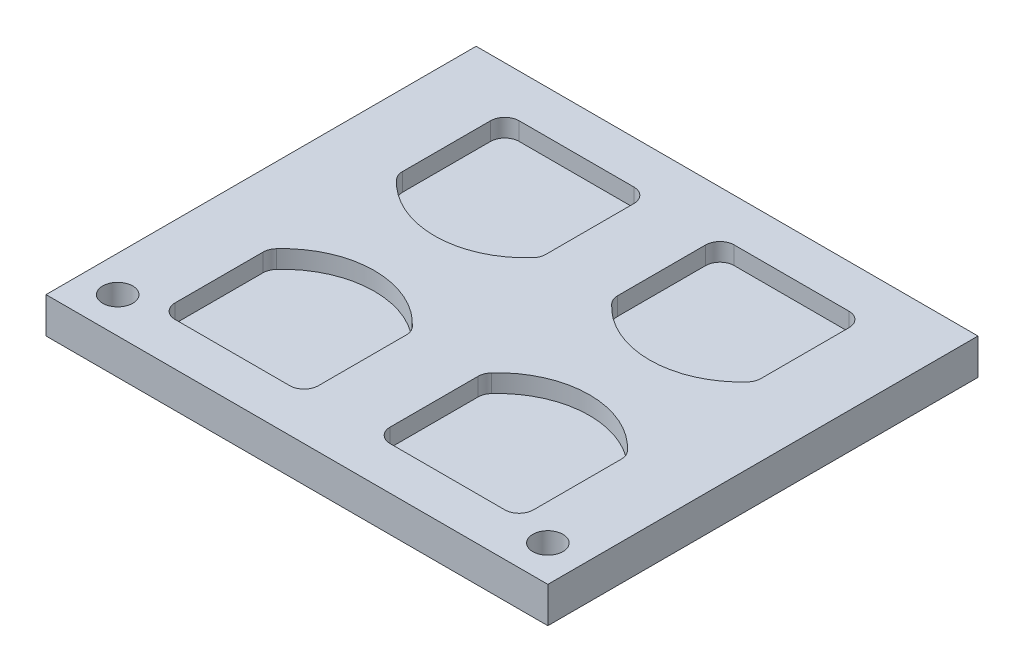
ISO-10303-21;
HEADER;
FILE_DESCRIPTION(('STEP AP214'),'2;1');
FILE_NAME('part.step','',(''),(''),'','','');
FILE_SCHEMA(('AUTOMOTIVE_DESIGN { 1 0 10303 214 1 1 1 1 }'));
ENDSEC;
DATA;
#1=APPLICATION_CONTEXT('core data for automotive mechanical design processes');
#2=APPLICATION_PROTOCOL_DEFINITION('international standard','automotive_design',2000,#1);
#3=PRODUCT_CONTEXT('',#1,'mechanical');
#4=PRODUCT('Part','Part','',(#3));
#5=PRODUCT_RELATED_PRODUCT_CATEGORY('part','',(#4));
#6=PRODUCT_DEFINITION_FORMATION('','',#4);
#7=PRODUCT_DEFINITION_CONTEXT('part definition',#1,'design');
#8=PRODUCT_DEFINITION('design','',#6,#7);
#9=PRODUCT_DEFINITION_SHAPE('','',#8);
#10=(LENGTH_UNIT() NAMED_UNIT(*) SI_UNIT(.MILLI.,.METRE.));
#11=(NAMED_UNIT(*) PLANE_ANGLE_UNIT() SI_UNIT($,.RADIAN.));
#12=(NAMED_UNIT(*) SI_UNIT($,.STERADIAN.) SOLID_ANGLE_UNIT());
#13=UNCERTAINTY_MEASURE_WITH_UNIT(LENGTH_MEASURE(1.E-05),#10,'distance_accuracy_value','');
#14=(GEOMETRIC_REPRESENTATION_CONTEXT(3) GLOBAL_UNCERTAINTY_ASSIGNED_CONTEXT((#13)) GLOBAL_UNIT_ASSIGNED_CONTEXT((#10,
#11,#12)) REPRESENTATION_CONTEXT('',''));
#15=CARTESIAN_POINT('',(0.,0.,0.));
#16=DIRECTION('',(0.,0.,1.));
#17=DIRECTION('',(1.,0.,0.));
#18=AXIS2_PLACEMENT_3D('',#15,#16,#17);
#19=CARTESIAN_POINT('',(0.,0.,0.));
#20=DIRECTION('',(0.,-1.,0.));
#21=DIRECTION('',(0.,0.,-1.));
#22=AXIS2_PLACEMENT_3D('',#19,#20,#21);
#23=PLANE('',#22);
#24=DIRECTION('',(0.,0.,-1.));
#25=VECTOR('',#24,1.);
#26=CARTESIAN_POINT('',(175.,0.,150.));
#27=LINE('',#26,#25);
#28=CARTESIAN_POINT('',(175.,0.,150.));
#29=VERTEX_POINT('',#28);
#30=CARTESIAN_POINT('',(175.,0.,-150.));
#31=VERTEX_POINT('',#30);
#32=EDGE_CURVE('E299',#29,#31,#27,.T.);
#33=ORIENTED_EDGE('',*,*,#32,.F.);
#34=DIRECTION('',(1.,0.,0.));
#35=VECTOR('',#34,1.);
#36=CARTESIAN_POINT('',(-175.,0.,150.));
#37=LINE('',#36,#35);
#38=CARTESIAN_POINT('',(-175.,0.,150.));
#39=VERTEX_POINT('',#38);
#40=EDGE_CURVE('E295',#39,#29,#37,.T.);
#41=ORIENTED_EDGE('',*,*,#40,.F.);
#42=DIRECTION('',(0.,0.,1.));
#43=VECTOR('',#42,1.);
#44=CARTESIAN_POINT('',(-175.,0.,150.));
#45=LINE('',#44,#43);
#46=CARTESIAN_POINT('',(-175.,0.,-150.));
#47=VERTEX_POINT('',#46);
#48=EDGE_CURVE('E369',#47,#39,#45,.T.);
#49=ORIENTED_EDGE('',*,*,#48,.F.);
#50=DIRECTION('',(-1.,0.,0.));
#51=VECTOR('',#50,1.);
#52=CARTESIAN_POINT('',(-175.,0.,-150.));
#53=LINE('',#52,#51);
#54=EDGE_CURVE('E366',#31,#47,#53,.T.);
#55=ORIENTED_EDGE('',*,*,#54,.F.);
#56=EDGE_LOOP('',(#33,#41,#49,#55));
#57=FACE_BOUND('',#56,.T.);
#58=CARTESIAN_POINT('',(150.,0.,125.));
#59=DIRECTION('',(0.,1.,0.));
#60=DIRECTION('',(0.,0.,1.));
#61=AXIS2_PLACEMENT_3D('',#58,#59,#60);
#62=CIRCLE('',#61,10.5);
#63=CARTESIAN_POINT('',(150.,0.,135.5));
#64=VERTEX_POINT('',#63);
#65=EDGE_CURVE('E391',#64,#64,#62,.T.);
#66=ORIENTED_EDGE('',*,*,#65,.T.);
#67=EDGE_LOOP('',(#66));
#68=FACE_BOUND('',#67,.T.);
#69=CARTESIAN_POINT('',(-150.,0.,125.));
#70=DIRECTION('',(0.,1.,0.));
#71=DIRECTION('',(0.,0.,1.));
#72=AXIS2_PLACEMENT_3D('',#69,#70,#71);
#73=CIRCLE('',#72,10.5);
#74=CARTESIAN_POINT('',(-150.,0.,135.5));
#75=VERTEX_POINT('',#74);
#76=EDGE_CURVE('E381',#75,#75,#73,.T.);
#77=ORIENTED_EDGE('',*,*,#76,.T.);
#78=EDGE_LOOP('',(#77));
#79=FACE_BOUND('',#78,.T.);
#80=ADVANCED_FACE('F43',(#57,#68,#79),#23,.T.);
#81=CARTESIAN_POINT('',(175.,25.,150.));
#82=DIRECTION('',(-1.,0.,0.));
#83=DIRECTION('',(0.,0.,1.));
#84=AXIS2_PLACEMENT_3D('',#81,#82,#83);
#85=PLANE('',#84);
#86=ORIENTED_EDGE('',*,*,#32,.T.);
#87=DIRECTION('',(0.,-1.,0.));
#88=VECTOR('',#87,1.);
#89=CARTESIAN_POINT('',(175.,25.,-150.));
#90=LINE('',#89,#88);
#91=CARTESIAN_POINT('',(175.,25.,-150.));
#92=VERTEX_POINT('',#91);
#93=EDGE_CURVE('E279',#92,#31,#90,.T.);
#94=ORIENTED_EDGE('',*,*,#93,.F.);
#95=DIRECTION('',(0.,0.,-1.));
#96=VECTOR('',#95,1.);
#97=CARTESIAN_POINT('',(175.,25.,150.));
#98=LINE('',#97,#96);
#99=CARTESIAN_POINT('',(175.,25.,150.));
#100=VERTEX_POINT('',#99);
#101=EDGE_CURVE('E286',#100,#92,#98,.T.);
#102=ORIENTED_EDGE('',*,*,#101,.F.);
#103=DIRECTION('',(0.,-1.,0.));
#104=VECTOR('',#103,1.);
#105=CARTESIAN_POINT('',(175.,25.,150.));
#106=LINE('',#105,#104);
#107=EDGE_CURVE('E363',#100,#29,#106,.T.);
#108=ORIENTED_EDGE('',*,*,#107,.T.);
#109=EDGE_LOOP('',(#86,#94,#102,#108));
#110=FACE_BOUND('',#109,.T.);
#111=ADVANCED_FACE('F297',(#110),#85,.F.);
#112=CARTESIAN_POINT('',(-175.,25.,-150.));
#113=DIRECTION('',(0.,0.,1.));
#114=DIRECTION('',(1.,0.,0.));
#115=AXIS2_PLACEMENT_3D('',#112,#113,#114);
#116=PLANE('',#115);
#117=ORIENTED_EDGE('',*,*,#54,.T.);
#118=DIRECTION('',(0.,-1.,0.));
#119=VECTOR('',#118,1.);
#120=CARTESIAN_POINT('',(-175.,25.,-150.));
#121=LINE('',#120,#119);
#122=CARTESIAN_POINT('',(-175.,25.,-150.));
#123=VERTEX_POINT('',#122);
#124=EDGE_CURVE('E282',#123,#47,#121,.T.);
#125=ORIENTED_EDGE('',*,*,#124,.F.);
#126=DIRECTION('',(-1.,0.,0.));
#127=VECTOR('',#126,1.);
#128=CARTESIAN_POINT('',(-175.,25.,-150.));
#129=LINE('',#128,#127);
#130=EDGE_CURVE('E275',#92,#123,#129,.T.);
#131=ORIENTED_EDGE('',*,*,#130,.F.);
#132=ORIENTED_EDGE('',*,*,#93,.T.);
#133=EDGE_LOOP('',(#117,#125,#131,#132));
#134=FACE_BOUND('',#133,.T.);
#135=ADVANCED_FACE('F277',(#134),#116,.F.);
#136=CARTESIAN_POINT('',(-175.,25.,150.));
#137=DIRECTION('',(1.,0.,0.));
#138=DIRECTION('',(0.,0.,-1.));
#139=AXIS2_PLACEMENT_3D('',#136,#137,#138);
#140=PLANE('',#139);
#141=ORIENTED_EDGE('',*,*,#48,.T.);
#142=DIRECTION('',(0.,-1.,0.));
#143=VECTOR('',#142,1.);
#144=CARTESIAN_POINT('',(-175.,25.,150.));
#145=LINE('',#144,#143);
#146=CARTESIAN_POINT('',(-175.,25.,150.));
#147=VERTEX_POINT('',#146);
#148=EDGE_CURVE('E304',#147,#39,#145,.T.);
#149=ORIENTED_EDGE('',*,*,#148,.F.);
#150=DIRECTION('',(0.,0.,1.));
#151=VECTOR('',#150,1.);
#152=CARTESIAN_POINT('',(-175.,25.,150.));
#153=LINE('',#152,#151);
#154=EDGE_CURVE('E285',#123,#147,#153,.T.);
#155=ORIENTED_EDGE('',*,*,#154,.F.);
#156=ORIENTED_EDGE('',*,*,#124,.T.);
#157=EDGE_LOOP('',(#141,#149,#155,#156));
#158=FACE_BOUND('',#157,.T.);
#159=ADVANCED_FACE('F712',(#158),#140,.F.);
#160=CARTESIAN_POINT('',(-175.,25.,150.));
#161=DIRECTION('',(0.,0.,-1.));
#162=DIRECTION('',(-1.,0.,0.));
#163=AXIS2_PLACEMENT_3D('',#160,#161,#162);
#164=PLANE('',#163);
#165=ORIENTED_EDGE('',*,*,#40,.T.);
#166=ORIENTED_EDGE('',*,*,#107,.F.);
#167=DIRECTION('',(1.,0.,0.));
#168=VECTOR('',#167,1.);
#169=CARTESIAN_POINT('',(-175.,25.,150.));
#170=LINE('',#169,#168);
#171=EDGE_CURVE('E291',#147,#100,#170,.T.);
#172=ORIENTED_EDGE('',*,*,#171,.F.);
#173=ORIENTED_EDGE('',*,*,#148,.T.);
#174=EDGE_LOOP('',(#165,#166,#172,#173));
#175=FACE_BOUND('',#174,.T.);
#176=ADVANCED_FACE('F709',(#175),#164,.F.);
#177=CARTESIAN_POINT('',(0.,25.,0.));
#178=DIRECTION('',(0.,-1.,0.));
#179=DIRECTION('',(0.,0.,-1.));
#180=AXIS2_PLACEMENT_3D('',#177,#178,#179);
#181=PLANE('',#180);
#182=CARTESIAN_POINT('',(-150.,25.,125.));
#183=DIRECTION('',(0.,1.,0.));
#184=DIRECTION('',(0.,0.,1.));
#185=AXIS2_PLACEMENT_3D('',#182,#183,#184);
#186=CIRCLE('',#185,10.5);
#187=CARTESIAN_POINT('',(-150.,25.,135.5));
#188=VERTEX_POINT('',#187);
#189=EDGE_CURVE('E386',#188,#188,#186,.T.);
#190=ORIENTED_EDGE('',*,*,#189,.F.);
#191=EDGE_LOOP('',(#190));
#192=FACE_BOUND('',#191,.T.);
#193=CARTESIAN_POINT('',(150.,25.,125.));
#194=DIRECTION('',(0.,1.,0.));
#195=DIRECTION('',(0.,0.,1.));
#196=AXIS2_PLACEMENT_3D('',#193,#194,#195);
#197=CIRCLE('',#196,10.5);
#198=CARTESIAN_POINT('',(150.,25.,135.5));
#199=VERTEX_POINT('',#198);
#200=EDGE_CURVE('E385',#199,#199,#197,.T.);
#201=ORIENTED_EDGE('',*,*,#200,.F.);
#202=EDGE_LOOP('',(#201));
#203=FACE_BOUND('',#202,.T.);
#204=DIRECTION('',(0.,0.,-1.));
#205=VECTOR('',#204,1.);
#206=CARTESIAN_POINT('',(-25.,25.,-120.));
#207=LINE('',#206,#205);
#208=CARTESIAN_POINT('',(-25.,25.,-48.6767959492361));
#209=VERTEX_POINT('',#208);
#210=CARTESIAN_POINT('',(-25.,25.,-110.));
#211=VERTEX_POINT('',#210);
#212=EDGE_CURVE('E495',#209,#211,#207,.T.);
#213=ORIENTED_EDGE('',*,*,#212,.F.);
#214=CARTESIAN_POINT('',(-35.,25.,-48.6767959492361));
#215=DIRECTION('',(0.,-1.,0.));
#216=DIRECTION('',(0.,0.,-1.));
#217=AXIS2_PLACEMENT_3D('',#214,#215,#216);
#218=CIRCLE('',#217,10.);
#219=CARTESIAN_POINT('',(-27.5968757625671,25.,-41.9541661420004));
#220=VERTEX_POINT('',#219);
#221=EDGE_CURVE('E491',#209,#220,#218,.T.);
#222=ORIENTED_EDGE('',*,*,#221,.T.);
#223=CARTESIAN_POINT('',(-75.,25.,-85.));
#224=DIRECTION('',(0.,1.,0.));
#225=DIRECTION('',(0.,0.,-1.));
#226=AXIS2_PLACEMENT_3D('',#223,#224,#225);
#227=CIRCLE('',#226,64.0312423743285);
#228=CARTESIAN_POINT('',(-122.403124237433,25.,-41.9541661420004));
#229=VERTEX_POINT('',#228);
#230=EDGE_CURVE('E502',#229,#220,#227,.T.);
#231=ORIENTED_EDGE('',*,*,#230,.F.);
#232=CARTESIAN_POINT('',(-115.,25.,-48.6767959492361));
#233=DIRECTION('',(0.,-1.,0.));
#234=DIRECTION('',(0.,0.,-1.));
#235=AXIS2_PLACEMENT_3D('',#232,#233,#234);
#236=CIRCLE('',#235,10.);
#237=CARTESIAN_POINT('',(-125.,25.,-48.6767959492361));
#238=VERTEX_POINT('',#237);
#239=EDGE_CURVE('E489',#229,#238,#236,.T.);
#240=ORIENTED_EDGE('',*,*,#239,.T.);
#241=DIRECTION('',(0.,0.,1.));
#242=VECTOR('',#241,1.);
#243=CARTESIAN_POINT('',(-125.,25.,-120.));
#244=LINE('',#243,#242);
#245=CARTESIAN_POINT('',(-125.,25.,-110.));
#246=VERTEX_POINT('',#245);
#247=EDGE_CURVE('E407',#246,#238,#244,.T.);
#248=ORIENTED_EDGE('',*,*,#247,.F.);
#249=CARTESIAN_POINT('',(-115.,25.,-110.));
#250=DIRECTION('',(0.,-1.,0.));
#251=DIRECTION('',(0.,0.,-1.));
#252=AXIS2_PLACEMENT_3D('',#249,#250,#251);
#253=CIRCLE('',#252,10.);
#254=CARTESIAN_POINT('',(-115.,25.,-120.));
#255=VERTEX_POINT('',#254);
#256=EDGE_CURVE('E12',#246,#255,#253,.T.);
#257=ORIENTED_EDGE('',*,*,#256,.T.);
#258=DIRECTION('',(-1.,0.,0.));
#259=VECTOR('',#258,1.);
#260=CARTESIAN_POINT('',(-125.,25.,-120.));
#261=LINE('',#260,#259);
#262=CARTESIAN_POINT('',(-35.,25.,-120.));
#263=VERTEX_POINT('',#262);
#264=EDGE_CURVE('E496',#263,#255,#261,.T.);
#265=ORIENTED_EDGE('',*,*,#264,.F.);
#266=CARTESIAN_POINT('',(-35.,25.,-110.));
#267=DIRECTION('',(0.,-1.,0.));
#268=DIRECTION('',(0.,0.,-1.));
#269=AXIS2_PLACEMENT_3D('',#266,#267,#268);
#270=CIRCLE('',#269,10.);
#271=EDGE_CURVE('E51',#263,#211,#270,.T.);
#272=ORIENTED_EDGE('',*,*,#271,.T.);
#273=EDGE_LOOP('',(#213,#222,#231,#240,#248,#257,#265,#272));
#274=FACE_BOUND('',#273,.T.);
#275=DIRECTION('',(0.,0.,-1.));
#276=VECTOR('',#275,1.);
#277=CARTESIAN_POINT('',(125.,25.,-120.));
#278=LINE('',#277,#276);
#279=CARTESIAN_POINT('',(125.,25.,-48.6767959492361));
#280=VERTEX_POINT('',#279);
#281=CARTESIAN_POINT('',(125.,25.,-110.));
#282=VERTEX_POINT('',#281);
#283=EDGE_CURVE('E541',#280,#282,#278,.T.);
#284=ORIENTED_EDGE('',*,*,#283,.F.);
#285=CARTESIAN_POINT('',(115.,25.,-48.6767959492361));
#286=DIRECTION('',(0.,-1.,0.));
#287=DIRECTION('',(0.,0.,-1.));
#288=AXIS2_PLACEMENT_3D('',#285,#286,#287);
#289=CIRCLE('',#288,10.);
#290=CARTESIAN_POINT('',(122.403124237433,25.,-41.9541661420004));
#291=VERTEX_POINT('',#290);
#292=EDGE_CURVE('E471',#280,#291,#289,.T.);
#293=ORIENTED_EDGE('',*,*,#292,.T.);
#294=CARTESIAN_POINT('',(75.,25.,-85.));
#295=DIRECTION('',(0.,1.,0.));
#296=DIRECTION('',(0.,0.,1.));
#297=AXIS2_PLACEMENT_3D('',#294,#295,#296);
#298=CIRCLE('',#297,64.0312423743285);
#299=CARTESIAN_POINT('',(27.5968757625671,25.,-41.9541661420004));
#300=VERTEX_POINT('',#299);
#301=EDGE_CURVE('E518',#300,#291,#298,.T.);
#302=ORIENTED_EDGE('',*,*,#301,.F.);
#303=CARTESIAN_POINT('',(35.,25.,-48.6767959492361));
#304=DIRECTION('',(0.,-1.,0.));
#305=DIRECTION('',(0.,0.,-1.));
#306=AXIS2_PLACEMENT_3D('',#303,#304,#305);
#307=CIRCLE('',#306,10.);
#308=CARTESIAN_POINT('',(25.,25.,-48.6767959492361));
#309=VERTEX_POINT('',#308);
#310=EDGE_CURVE('E465',#300,#309,#307,.T.);
#311=ORIENTED_EDGE('',*,*,#310,.T.);
#312=DIRECTION('',(0.,0.,1.));
#313=VECTOR('',#312,1.);
#314=CARTESIAN_POINT('',(25.,25.,-120.));
#315=LINE('',#314,#313);
#316=CARTESIAN_POINT('',(25.,25.,-110.));
#317=VERTEX_POINT('',#316);
#318=EDGE_CURVE('E535',#317,#309,#315,.T.);
#319=ORIENTED_EDGE('',*,*,#318,.F.);
#320=CARTESIAN_POINT('',(35.,25.,-110.));
#321=DIRECTION('',(0.,-1.,0.));
#322=DIRECTION('',(0.,0.,-1.));
#323=AXIS2_PLACEMENT_3D('',#320,#321,#322);
#324=CIRCLE('',#323,10.);
#325=CARTESIAN_POINT('',(35.,25.,-120.));
#326=VERTEX_POINT('',#325);
#327=EDGE_CURVE('E467',#317,#326,#324,.T.);
#328=ORIENTED_EDGE('',*,*,#327,.T.);
#329=DIRECTION('',(-1.,0.,0.));
#330=VECTOR('',#329,1.);
#331=CARTESIAN_POINT('',(125.,25.,-120.));
#332=LINE('',#331,#330);
#333=CARTESIAN_POINT('',(115.,25.,-120.));
#334=VERTEX_POINT('',#333);
#335=EDGE_CURVE('E538',#334,#326,#332,.T.);
#336=ORIENTED_EDGE('',*,*,#335,.F.);
#337=CARTESIAN_POINT('',(115.,25.,-110.));
#338=DIRECTION('',(0.,-1.,0.));
#339=DIRECTION('',(0.,0.,-1.));
#340=AXIS2_PLACEMENT_3D('',#337,#338,#339);
#341=CIRCLE('',#340,10.);
#342=EDGE_CURVE('E469',#334,#282,#341,.T.);
#343=ORIENTED_EDGE('',*,*,#342,.T.);
#344=EDGE_LOOP('',(#284,#293,#302,#311,#319,#328,#336,#343));
#345=FACE_BOUND('',#344,.T.);
#346=DIRECTION('',(0.,0.,1.));
#347=VECTOR('',#346,1.);
#348=CARTESIAN_POINT('',(25.,25.,120.));
#349=LINE('',#348,#347);
#350=CARTESIAN_POINT('',(25.,25.,48.6767959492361));
#351=VERTEX_POINT('',#350);
#352=CARTESIAN_POINT('',(25.,25.,110.));
#353=VERTEX_POINT('',#352);
#354=EDGE_CURVE('E1142',#351,#353,#349,.T.);
#355=ORIENTED_EDGE('',*,*,#354,.F.);
#356=CARTESIAN_POINT('',(35.,25.,48.6767959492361));
#357=DIRECTION('',(0.,-1.,0.));
#358=DIRECTION('',(0.,0.,-1.));
#359=AXIS2_PLACEMENT_3D('',#356,#357,#358);
#360=CIRCLE('',#359,10.);
#361=CARTESIAN_POINT('',(27.5968757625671,25.,41.9541661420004));
#362=VERTEX_POINT('',#361);
#363=EDGE_CURVE('E479',#351,#362,#360,.T.);
#364=ORIENTED_EDGE('',*,*,#363,.T.);
#365=CARTESIAN_POINT('',(75.,25.,85.));
#366=DIRECTION('',(0.,1.,0.));
#367=DIRECTION('',(0.,0.,-1.));
#368=AXIS2_PLACEMENT_3D('',#365,#366,#367);
#369=CIRCLE('',#368,64.0312423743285);
#370=CARTESIAN_POINT('',(122.403124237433,25.,41.9541661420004));
#371=VERTEX_POINT('',#370);
#372=EDGE_CURVE('E632',#371,#362,#369,.T.);
#373=ORIENTED_EDGE('',*,*,#372,.F.);
#374=CARTESIAN_POINT('',(115.,25.,48.6767959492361));
#375=DIRECTION('',(0.,-1.,0.));
#376=DIRECTION('',(0.,0.,-1.));
#377=AXIS2_PLACEMENT_3D('',#374,#375,#376);
#378=CIRCLE('',#377,10.);
#379=CARTESIAN_POINT('',(125.,25.,48.6767959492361));
#380=VERTEX_POINT('',#379);
#381=EDGE_CURVE('E477',#371,#380,#378,.T.);
#382=ORIENTED_EDGE('',*,*,#381,.T.);
#383=DIRECTION('',(0.,0.,-1.));
#384=VECTOR('',#383,1.);
#385=CARTESIAN_POINT('',(125.,25.,120.));
#386=LINE('',#385,#384);
#387=CARTESIAN_POINT('',(125.,25.,110.));
#388=VERTEX_POINT('',#387);
#389=EDGE_CURVE('E1146',#388,#380,#386,.T.);
#390=ORIENTED_EDGE('',*,*,#389,.F.);
#391=CARTESIAN_POINT('',(115.,25.,110.));
#392=DIRECTION('',(0.,-1.,0.));
#393=DIRECTION('',(0.,0.,-1.));
#394=AXIS2_PLACEMENT_3D('',#391,#392,#393);
#395=CIRCLE('',#394,10.);
#396=CARTESIAN_POINT('',(115.,25.,120.));
#397=VERTEX_POINT('',#396);
#398=EDGE_CURVE('E475',#388,#397,#395,.T.);
#399=ORIENTED_EDGE('',*,*,#398,.T.);
#400=DIRECTION('',(1.,0.,0.));
#401=VECTOR('',#400,1.);
#402=CARTESIAN_POINT('',(125.,25.,120.));
#403=LINE('',#402,#401);
#404=CARTESIAN_POINT('',(35.,25.,120.));
#405=VERTEX_POINT('',#404);
#406=EDGE_CURVE('E1143',#405,#397,#403,.T.);
#407=ORIENTED_EDGE('',*,*,#406,.F.);
#408=CARTESIAN_POINT('',(35.,25.,110.));
#409=DIRECTION('',(0.,-1.,0.));
#410=DIRECTION('',(0.,0.,-1.));
#411=AXIS2_PLACEMENT_3D('',#408,#409,#410);
#412=CIRCLE('',#411,10.);
#413=EDGE_CURVE('E473',#405,#353,#412,.T.);
#414=ORIENTED_EDGE('',*,*,#413,.T.);
#415=EDGE_LOOP('',(#355,#364,#373,#382,#390,#399,#407,#414));
#416=FACE_BOUND('',#415,.T.);
#417=DIRECTION('',(1.,0.,0.));
#418=VECTOR('',#417,1.);
#419=CARTESIAN_POINT('',(-125.,25.,120.));
#420=LINE('',#419,#418);
#421=CARTESIAN_POINT('',(-115.,25.,120.));
#422=VERTEX_POINT('',#421);
#423=CARTESIAN_POINT('',(-35.,25.,120.));
#424=VERTEX_POINT('',#423);
#425=EDGE_CURVE('E644',#422,#424,#420,.T.);
#426=ORIENTED_EDGE('',*,*,#425,.F.);
#427=CARTESIAN_POINT('',(-115.,25.,110.));
#428=DIRECTION('',(0.,-1.,0.));
#429=DIRECTION('',(0.,0.,-1.));
#430=AXIS2_PLACEMENT_3D('',#427,#428,#429);
#431=CIRCLE('',#430,10.);
#432=CARTESIAN_POINT('',(-125.,25.,110.));
#433=VERTEX_POINT('',#432);
#434=EDGE_CURVE('E481',#422,#433,#431,.T.);
#435=ORIENTED_EDGE('',*,*,#434,.T.);
#436=DIRECTION('',(0.,0.,1.));
#437=VECTOR('',#436,1.);
#438=CARTESIAN_POINT('',(-125.,25.,120.));
#439=LINE('',#438,#437);
#440=CARTESIAN_POINT('',(-125.,25.,48.6767959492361));
#441=VERTEX_POINT('',#440);
#442=EDGE_CURVE('E631',#441,#433,#439,.T.);
#443=ORIENTED_EDGE('',*,*,#442,.F.);
#444=CARTESIAN_POINT('',(-115.,25.,48.6767959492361));
#445=DIRECTION('',(0.,-1.,0.));
#446=DIRECTION('',(0.,0.,-1.));
#447=AXIS2_PLACEMENT_3D('',#444,#445,#446);
#448=CIRCLE('',#447,10.);
#449=CARTESIAN_POINT('',(-122.403124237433,25.,41.9541661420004));
#450=VERTEX_POINT('',#449);
#451=EDGE_CURVE('E487',#441,#450,#448,.T.);
#452=ORIENTED_EDGE('',*,*,#451,.T.);
#453=CARTESIAN_POINT('',(-75.,25.,85.));
#454=DIRECTION('',(0.,1.,0.));
#455=DIRECTION('',(0.,0.,1.));
#456=AXIS2_PLACEMENT_3D('',#453,#454,#455);
#457=CIRCLE('',#456,64.0312423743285);
#458=CARTESIAN_POINT('',(-27.5968757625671,25.,41.9541661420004));
#459=VERTEX_POINT('',#458);
#460=EDGE_CURVE('E406',#459,#450,#457,.T.);
#461=ORIENTED_EDGE('',*,*,#460,.F.);
#462=CARTESIAN_POINT('',(-35.,25.,48.6767959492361));
#463=DIRECTION('',(0.,-1.,0.));
#464=DIRECTION('',(0.,0.,-1.));
#465=AXIS2_PLACEMENT_3D('',#462,#463,#464);
#466=CIRCLE('',#465,10.);
#467=CARTESIAN_POINT('',(-25.,25.,48.6767959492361));
#468=VERTEX_POINT('',#467);
#469=EDGE_CURVE('E485',#459,#468,#466,.T.);
#470=ORIENTED_EDGE('',*,*,#469,.T.);
#471=DIRECTION('',(0.,0.,-1.));
#472=VECTOR('',#471,1.);
#473=CARTESIAN_POINT('',(-25.,25.,120.));
#474=LINE('',#473,#472);
#475=CARTESIAN_POINT('',(-25.,25.,110.));
#476=VERTEX_POINT('',#475);
#477=EDGE_CURVE('E641',#476,#468,#474,.T.);
#478=ORIENTED_EDGE('',*,*,#477,.F.);
#479=CARTESIAN_POINT('',(-35.,25.,110.));
#480=DIRECTION('',(0.,-1.,0.));
#481=DIRECTION('',(0.,0.,-1.));
#482=AXIS2_PLACEMENT_3D('',#479,#480,#481);
#483=CIRCLE('',#482,10.);
#484=EDGE_CURVE('E483',#476,#424,#483,.T.);
#485=ORIENTED_EDGE('',*,*,#484,.T.);
#486=EDGE_LOOP('',(#426,#435,#443,#452,#461,#470,#478,#485));
#487=FACE_BOUND('',#486,.T.);
#488=ORIENTED_EDGE('',*,*,#101,.T.);
#489=ORIENTED_EDGE('',*,*,#130,.T.);
#490=ORIENTED_EDGE('',*,*,#154,.T.);
#491=ORIENTED_EDGE('',*,*,#171,.T.);
#492=EDGE_LOOP('',(#488,#489,#490,#491));
#493=FACE_BOUND('',#492,.T.);
#494=ADVANCED_FACE('F289',(#192,#203,#274,#345,#416,#487,#493),#181,.F.);
#495=CARTESIAN_POINT('',(-125.,12.5,120.));
#496=DIRECTION('',(-1.,0.,0.));
#497=DIRECTION('',(0.,0.,1.));
#498=AXIS2_PLACEMENT_3D('',#495,#496,#497);
#499=PLANE('',#498);
#500=ORIENTED_EDGE('',*,*,#442,.T.);
#501=DIRECTION('',(0.,1.,0.));
#502=VECTOR('',#501,1.);
#503=CARTESIAN_POINT('',(-125.,12.5,110.));
#504=LINE('',#503,#502);
#505=CARTESIAN_POINT('',(-125.,12.5,110.));
#506=VERTEX_POINT('',#505);
#507=EDGE_CURVE('E608',#433,#506,#504,.F.);
#508=ORIENTED_EDGE('',*,*,#507,.T.);
#509=DIRECTION('',(0.,0.,1.));
#510=VECTOR('',#509,1.);
#511=CARTESIAN_POINT('',(-125.,12.5,120.));
#512=LINE('',#511,#510);
#513=CARTESIAN_POINT('',(-125.,12.5,48.6767959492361));
#514=VERTEX_POINT('',#513);
#515=EDGE_CURVE('E400',#514,#506,#512,.T.);
#516=ORIENTED_EDGE('',*,*,#515,.F.);
#517=DIRECTION('',(0.,-1.,0.));
#518=VECTOR('',#517,1.);
#519=CARTESIAN_POINT('',(-125.,25.,48.6767959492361));
#520=LINE('',#519,#518);
#521=EDGE_CURVE('E605',#514,#441,#520,.F.);
#522=ORIENTED_EDGE('',*,*,#521,.T.);
#523=EDGE_LOOP('',(#500,#508,#516,#522));
#524=FACE_BOUND('',#523,.T.);
#525=ADVANCED_FACE('F677',(#524),#499,.F.);
#526=CARTESIAN_POINT('',(-75.,12.5,85.));
#527=DIRECTION('',(0.,1.,0.));
#528=DIRECTION('',(0.,0.,1.));
#529=AXIS2_PLACEMENT_3D('',#526,#527,#528);
#530=CYLINDRICAL_SURFACE('',#529,64.0312423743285);
#531=CARTESIAN_POINT('',(-75.,12.5,85.));
#532=DIRECTION('',(0.,1.,0.));
#533=DIRECTION('',(0.,0.,1.));
#534=AXIS2_PLACEMENT_3D('',#531,#532,#533);
#535=CIRCLE('',#534,64.0312423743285);
#536=CARTESIAN_POINT('',(-27.5968757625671,12.5,41.9541661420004));
#537=VERTEX_POINT('',#536);
#538=CARTESIAN_POINT('',(-122.403124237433,12.5,41.9541661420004));
#539=VERTEX_POINT('',#538);
#540=EDGE_CURVE('E367',#537,#539,#535,.T.);
#541=ORIENTED_EDGE('',*,*,#540,.F.);
#542=DIRECTION('',(0.,1.,0.));
#543=VECTOR('',#542,1.);
#544=CARTESIAN_POINT('',(-27.5968757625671,12.5,41.9541661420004));
#545=LINE('',#544,#543);
#546=EDGE_CURVE('E435',#537,#459,#545,.T.);
#547=ORIENTED_EDGE('',*,*,#546,.T.);
#548=ORIENTED_EDGE('',*,*,#460,.T.);
#549=DIRECTION('',(0.,1.,0.));
#550=VECTOR('',#549,1.);
#551=CARTESIAN_POINT('',(-122.403124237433,12.5,41.9541661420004));
#552=LINE('',#551,#550);
#553=EDGE_CURVE('E433',#450,#539,#552,.F.);
#554=ORIENTED_EDGE('',*,*,#553,.T.);
#555=EDGE_LOOP('',(#541,#547,#548,#554));
#556=FACE_BOUND('',#555,.T.);
#557=ADVANCED_FACE('F666',(#556),#530,.F.);
#558=CARTESIAN_POINT('',(-25.,12.5,120.));
#559=DIRECTION('',(1.,0.,0.));
#560=DIRECTION('',(0.,0.,-1.));
#561=AXIS2_PLACEMENT_3D('',#558,#559,#560);
#562=PLANE('',#561);
#563=DIRECTION('',(0.,0.,-1.));
#564=VECTOR('',#563,1.);
#565=CARTESIAN_POINT('',(-25.,12.5,120.));
#566=LINE('',#565,#564);
#567=CARTESIAN_POINT('',(-25.,12.5,110.));
#568=VERTEX_POINT('',#567);
#569=CARTESIAN_POINT('',(-25.,12.5,48.6767959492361));
#570=VERTEX_POINT('',#569);
#571=EDGE_CURVE('E412',#568,#570,#566,.T.);
#572=ORIENTED_EDGE('',*,*,#571,.F.);
#573=DIRECTION('',(0.,1.,0.));
#574=VECTOR('',#573,1.);
#575=CARTESIAN_POINT('',(-25.,25.,110.));
#576=LINE('',#575,#574);
#577=EDGE_CURVE('E430',#568,#476,#576,.T.);
#578=ORIENTED_EDGE('',*,*,#577,.T.);
#579=ORIENTED_EDGE('',*,*,#477,.T.);
#580=DIRECTION('',(0.,-1.,0.));
#581=VECTOR('',#580,1.);
#582=CARTESIAN_POINT('',(-25.,12.5,48.6767959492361));
#583=LINE('',#582,#581);
#584=EDGE_CURVE('E428',#468,#570,#583,.T.);
#585=ORIENTED_EDGE('',*,*,#584,.T.);
#586=EDGE_LOOP('',(#572,#578,#579,#585));
#587=FACE_BOUND('',#586,.T.);
#588=ADVANCED_FACE('F689',(#587),#562,.F.);
#589=CARTESIAN_POINT('',(-125.,12.5,120.));
#590=DIRECTION('',(0.,0.,1.));
#591=DIRECTION('',(1.,0.,0.));
#592=AXIS2_PLACEMENT_3D('',#589,#590,#591);
#593=PLANE('',#592);
#594=DIRECTION('',(1.,0.,0.));
#595=VECTOR('',#594,1.);
#596=CARTESIAN_POINT('',(-125.,12.5,120.));
#597=LINE('',#596,#595);
#598=CARTESIAN_POINT('',(-115.,12.5,120.));
#599=VERTEX_POINT('',#598);
#600=CARTESIAN_POINT('',(-35.,12.5,120.));
#601=VERTEX_POINT('',#600);
#602=EDGE_CURVE('E405',#599,#601,#597,.T.);
#603=ORIENTED_EDGE('',*,*,#602,.F.);
#604=DIRECTION('',(0.,1.,0.));
#605=VECTOR('',#604,1.);
#606=CARTESIAN_POINT('',(-115.,25.,120.));
#607=LINE('',#606,#605);
#608=EDGE_CURVE('E602',#599,#422,#607,.T.);
#609=ORIENTED_EDGE('',*,*,#608,.T.);
#610=ORIENTED_EDGE('',*,*,#425,.T.);
#611=DIRECTION('',(0.,1.,0.));
#612=VECTOR('',#611,1.);
#613=CARTESIAN_POINT('',(-35.,12.5,120.));
#614=LINE('',#613,#612);
#615=EDGE_CURVE('E600',#424,#601,#614,.F.);
#616=ORIENTED_EDGE('',*,*,#615,.T.);
#617=EDGE_LOOP('',(#603,#609,#610,#616));
#618=FACE_BOUND('',#617,.T.);
#619=ADVANCED_FACE('F685',(#618),#593,.F.);
#620=CARTESIAN_POINT('',(-75.,12.5,85.));
#621=DIRECTION('',(0.,1.,0.));
#622=DIRECTION('',(0.,0.,1.));
#623=AXIS2_PLACEMENT_3D('',#620,#621,#622);
#624=PLANE('',#623);
#625=ORIENTED_EDGE('',*,*,#515,.T.);
#626=CARTESIAN_POINT('',(-115.,12.5,110.));
#627=DIRECTION('',(0.,1.,0.));
#628=DIRECTION('',(0.,0.,1.));
#629=AXIS2_PLACEMENT_3D('',#626,#627,#628);
#630=CIRCLE('',#629,10.);
#631=EDGE_CURVE('E422',#506,#599,#630,.T.);
#632=ORIENTED_EDGE('',*,*,#631,.T.);
#633=ORIENTED_EDGE('',*,*,#602,.T.);
#634=CARTESIAN_POINT('',(-35.,12.5,110.));
#635=DIRECTION('',(0.,1.,0.));
#636=DIRECTION('',(0.,0.,1.));
#637=AXIS2_PLACEMENT_3D('',#634,#635,#636);
#638=CIRCLE('',#637,10.);
#639=EDGE_CURVE('E419',#601,#568,#638,.T.);
#640=ORIENTED_EDGE('',*,*,#639,.T.);
#641=ORIENTED_EDGE('',*,*,#571,.T.);
#642=CARTESIAN_POINT('',(-35.,12.5,48.6767959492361));
#643=DIRECTION('',(0.,1.,0.));
#644=DIRECTION('',(0.,0.,1.));
#645=AXIS2_PLACEMENT_3D('',#642,#643,#644);
#646=CIRCLE('',#645,10.);
#647=EDGE_CURVE('E423',#570,#537,#646,.T.);
#648=ORIENTED_EDGE('',*,*,#647,.T.);
#649=ORIENTED_EDGE('',*,*,#540,.T.);
#650=CARTESIAN_POINT('',(-115.,12.5,48.6767959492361));
#651=DIRECTION('',(0.,1.,0.));
#652=DIRECTION('',(0.,0.,1.));
#653=AXIS2_PLACEMENT_3D('',#650,#651,#652);
#654=CIRCLE('',#653,10.);
#655=EDGE_CURVE('E609',#539,#514,#654,.T.);
#656=ORIENTED_EDGE('',*,*,#655,.T.);
#657=EDGE_LOOP('',(#625,#632,#633,#640,#641,#648,#649,#656));
#658=FACE_BOUND('',#657,.T.);
#659=ADVANCED_FACE('F656',(#658),#624,.T.);
#660=CARTESIAN_POINT('',(75.,12.5,85.));
#661=DIRECTION('',(0.,1.,0.));
#662=DIRECTION('',(0.,0.,1.));
#663=AXIS2_PLACEMENT_3D('',#660,#661,#662);
#664=CYLINDRICAL_SURFACE('',#663,64.0312423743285);
#665=CARTESIAN_POINT('',(75.,12.5,85.));
#666=DIRECTION('',(0.,1.,0.));
#667=DIRECTION('',(0.,0.,-1.));
#668=AXIS2_PLACEMENT_3D('',#665,#666,#667);
#669=CIRCLE('',#668,64.0312423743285);
#670=CARTESIAN_POINT('',(122.403124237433,12.5,41.9541661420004));
#671=VERTEX_POINT('',#670);
#672=CARTESIAN_POINT('',(27.5968757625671,12.5,41.9541661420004));
#673=VERTEX_POINT('',#672);
#674=EDGE_CURVE('E622',#671,#673,#669,.T.);
#675=ORIENTED_EDGE('',*,*,#674,.F.);
#676=DIRECTION('',(0.,1.,0.));
#677=VECTOR('',#676,1.);
#678=CARTESIAN_POINT('',(122.403124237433,12.5,41.9541661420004));
#679=LINE('',#678,#677);
#680=EDGE_CURVE('E597',#671,#371,#679,.T.);
#681=ORIENTED_EDGE('',*,*,#680,.T.);
#682=ORIENTED_EDGE('',*,*,#372,.T.);
#683=DIRECTION('',(0.,1.,0.));
#684=VECTOR('',#683,1.);
#685=CARTESIAN_POINT('',(27.5968757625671,12.5,41.9541661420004));
#686=LINE('',#685,#684);
#687=EDGE_CURVE('E595',#362,#673,#686,.F.);
#688=ORIENTED_EDGE('',*,*,#687,.T.);
#689=EDGE_LOOP('',(#675,#681,#682,#688));
#690=FACE_BOUND('',#689,.T.);
#691=ADVANCED_FACE('F792',(#690),#664,.F.);
#692=CARTESIAN_POINT('',(125.,12.5,120.));
#693=DIRECTION('',(1.,0.,0.));
#694=DIRECTION('',(0.,0.,-1.));
#695=AXIS2_PLACEMENT_3D('',#692,#693,#694);
#696=PLANE('',#695);
#697=DIRECTION('',(0.,0.,-1.));
#698=VECTOR('',#697,1.);
#699=CARTESIAN_POINT('',(125.,12.5,120.));
#700=LINE('',#699,#698);
#701=CARTESIAN_POINT('',(125.,12.5,110.));
#702=VERTEX_POINT('',#701);
#703=CARTESIAN_POINT('',(125.,12.5,48.6767959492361));
#704=VERTEX_POINT('',#703);
#705=EDGE_CURVE('E627',#702,#704,#700,.T.);
#706=ORIENTED_EDGE('',*,*,#705,.F.);
#707=DIRECTION('',(0.,1.,0.));
#708=VECTOR('',#707,1.);
#709=CARTESIAN_POINT('',(125.,25.,110.));
#710=LINE('',#709,#708);
#711=EDGE_CURVE('E592',#702,#388,#710,.T.);
#712=ORIENTED_EDGE('',*,*,#711,.T.);
#713=ORIENTED_EDGE('',*,*,#389,.T.);
#714=DIRECTION('',(0.,-1.,0.));
#715=VECTOR('',#714,1.);
#716=CARTESIAN_POINT('',(125.,12.5,48.6767959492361));
#717=LINE('',#716,#715);
#718=EDGE_CURVE('E590',#380,#704,#717,.T.);
#719=ORIENTED_EDGE('',*,*,#718,.T.);
#720=EDGE_LOOP('',(#706,#712,#713,#719));
#721=FACE_BOUND('',#720,.T.);
#722=ADVANCED_FACE('F796',(#721),#696,.F.);
#723=CARTESIAN_POINT('',(125.,12.5,120.));
#724=DIRECTION('',(0.,0.,1.));
#725=DIRECTION('',(1.,0.,0.));
#726=AXIS2_PLACEMENT_3D('',#723,#724,#725);
#727=PLANE('',#726);
#728=DIRECTION('',(1.,0.,0.));
#729=VECTOR('',#728,1.);
#730=CARTESIAN_POINT('',(125.,12.5,120.));
#731=LINE('',#730,#729);
#732=CARTESIAN_POINT('',(35.,12.5,120.));
#733=VERTEX_POINT('',#732);
#734=CARTESIAN_POINT('',(115.,12.5,120.));
#735=VERTEX_POINT('',#734);
#736=EDGE_CURVE('E621',#733,#735,#731,.T.);
#737=ORIENTED_EDGE('',*,*,#736,.F.);
#738=DIRECTION('',(0.,1.,0.));
#739=VECTOR('',#738,1.);
#740=CARTESIAN_POINT('',(35.,25.,120.));
#741=LINE('',#740,#739);
#742=EDGE_CURVE('E570',#733,#405,#741,.T.);
#743=ORIENTED_EDGE('',*,*,#742,.T.);
#744=ORIENTED_EDGE('',*,*,#406,.T.);
#745=DIRECTION('',(0.,1.,0.));
#746=VECTOR('',#745,1.);
#747=CARTESIAN_POINT('',(115.,12.5,120.));
#748=LINE('',#747,#746);
#749=EDGE_CURVE('E568',#397,#735,#748,.F.);
#750=ORIENTED_EDGE('',*,*,#749,.T.);
#751=EDGE_LOOP('',(#737,#743,#744,#750));
#752=FACE_BOUND('',#751,.T.);
#753=ADVANCED_FACE('F802',(#752),#727,.F.);
#754=CARTESIAN_POINT('',(25.,12.5,120.));
#755=DIRECTION('',(-1.,0.,0.));
#756=DIRECTION('',(0.,0.,1.));
#757=AXIS2_PLACEMENT_3D('',#754,#755,#756);
#758=PLANE('',#757);
#759=ORIENTED_EDGE('',*,*,#354,.T.);
#760=DIRECTION('',(0.,1.,0.));
#761=VECTOR('',#760,1.);
#762=CARTESIAN_POINT('',(25.,12.5,110.));
#763=LINE('',#762,#761);
#764=CARTESIAN_POINT('',(25.,12.5,110.));
#765=VERTEX_POINT('',#764);
#766=EDGE_CURVE('E580',#353,#765,#763,.F.);
#767=ORIENTED_EDGE('',*,*,#766,.T.);
#768=DIRECTION('',(0.,0.,1.));
#769=VECTOR('',#768,1.);
#770=CARTESIAN_POINT('',(25.,12.5,120.));
#771=LINE('',#770,#769);
#772=CARTESIAN_POINT('',(25.,12.5,48.6767959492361));
#773=VERTEX_POINT('',#772);
#774=EDGE_CURVE('E618',#773,#765,#771,.T.);
#775=ORIENTED_EDGE('',*,*,#774,.F.);
#776=DIRECTION('',(0.,-1.,0.));
#777=VECTOR('',#776,1.);
#778=CARTESIAN_POINT('',(25.,25.,48.6767959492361));
#779=LINE('',#778,#777);
#780=EDGE_CURVE('E577',#773,#351,#779,.F.);
#781=ORIENTED_EDGE('',*,*,#780,.T.);
#782=EDGE_LOOP('',(#759,#767,#775,#781));
#783=FACE_BOUND('',#782,.T.);
#784=ADVANCED_FACE('F807',(#783),#758,.F.);
#785=CARTESIAN_POINT('',(75.,12.5,85.));
#786=DIRECTION('',(0.,-1.,0.));
#787=DIRECTION('',(0.,0.,-1.));
#788=AXIS2_PLACEMENT_3D('',#785,#786,#787);
#789=PLANE('',#788);
#790=ORIENTED_EDGE('',*,*,#774,.T.);
#791=CARTESIAN_POINT('',(35.,12.5,110.));
#792=DIRECTION('',(0.,-1.,0.));
#793=DIRECTION('',(0.,0.,-1.));
#794=AXIS2_PLACEMENT_3D('',#791,#792,#793);
#795=CIRCLE('',#794,10.);
#796=EDGE_CURVE('E588',#765,#733,#795,.F.);
#797=ORIENTED_EDGE('',*,*,#796,.T.);
#798=ORIENTED_EDGE('',*,*,#736,.T.);
#799=CARTESIAN_POINT('',(115.,12.5,110.));
#800=DIRECTION('',(0.,-1.,0.));
#801=DIRECTION('',(0.,0.,-1.));
#802=AXIS2_PLACEMENT_3D('',#799,#800,#801);
#803=CIRCLE('',#802,10.);
#804=EDGE_CURVE('E586',#735,#702,#803,.F.);
#805=ORIENTED_EDGE('',*,*,#804,.T.);
#806=ORIENTED_EDGE('',*,*,#705,.T.);
#807=CARTESIAN_POINT('',(115.,12.5,48.6767959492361));
#808=DIRECTION('',(0.,-1.,0.));
#809=DIRECTION('',(0.,0.,-1.));
#810=AXIS2_PLACEMENT_3D('',#807,#808,#809);
#811=CIRCLE('',#810,10.);
#812=EDGE_CURVE('E584',#704,#671,#811,.F.);
#813=ORIENTED_EDGE('',*,*,#812,.T.);
#814=ORIENTED_EDGE('',*,*,#674,.T.);
#815=CARTESIAN_POINT('',(35.,12.5,48.6767959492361));
#816=DIRECTION('',(0.,-1.,0.));
#817=DIRECTION('',(0.,0.,-1.));
#818=AXIS2_PLACEMENT_3D('',#815,#816,#817);
#819=CIRCLE('',#818,10.);
#820=EDGE_CURVE('E582',#673,#773,#819,.F.);
#821=ORIENTED_EDGE('',*,*,#820,.T.);
#822=EDGE_LOOP('',(#790,#797,#798,#805,#806,#813,#814,#821));
#823=FACE_BOUND('',#822,.T.);
#824=ADVANCED_FACE('F822',(#823),#789,.F.);
#825=CARTESIAN_POINT('',(75.,12.5,-85.));
#826=DIRECTION('',(0.,1.,0.));
#827=DIRECTION('',(0.,0.,1.));
#828=AXIS2_PLACEMENT_3D('',#825,#826,#827);
#829=CYLINDRICAL_SURFACE('',#828,64.0312423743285);
#830=CARTESIAN_POINT('',(75.,12.5,-85.));
#831=DIRECTION('',(0.,1.,0.));
#832=DIRECTION('',(0.,0.,1.));
#833=AXIS2_PLACEMENT_3D('',#830,#831,#832);
#834=CIRCLE('',#833,64.0312423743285);
#835=CARTESIAN_POINT('',(27.5968757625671,12.5,-41.9541661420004));
#836=VERTEX_POINT('',#835);
#837=CARTESIAN_POINT('',(122.403124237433,12.5,-41.9541661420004));
#838=VERTEX_POINT('',#837);
#839=EDGE_CURVE('E334',#836,#838,#834,.T.);
#840=ORIENTED_EDGE('',*,*,#839,.F.);
#841=DIRECTION('',(0.,1.,0.));
#842=VECTOR('',#841,1.);
#843=CARTESIAN_POINT('',(27.5968757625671,12.5,-41.9541661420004));
#844=LINE('',#843,#842);
#845=EDGE_CURVE('E302',#836,#300,#844,.T.);
#846=ORIENTED_EDGE('',*,*,#845,.T.);
#847=ORIENTED_EDGE('',*,*,#301,.T.);
#848=DIRECTION('',(0.,1.,0.));
#849=VECTOR('',#848,1.);
#850=CARTESIAN_POINT('',(122.403124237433,12.5,-41.9541661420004));
#851=LINE('',#850,#849);
#852=EDGE_CURVE('E300',#291,#838,#851,.F.);
#853=ORIENTED_EDGE('',*,*,#852,.T.);
#854=EDGE_LOOP('',(#840,#846,#847,#853));
#855=FACE_BOUND('',#854,.T.);
#856=ADVANCED_FACE('F548',(#855),#829,.F.);
#857=CARTESIAN_POINT('',(25.,12.5,-120.));
#858=DIRECTION('',(-1.,0.,0.));
#859=DIRECTION('',(0.,0.,1.));
#860=AXIS2_PLACEMENT_3D('',#857,#858,#859);
#861=PLANE('',#860);
#862=ORIENTED_EDGE('',*,*,#318,.T.);
#863=DIRECTION('',(0.,-1.,0.));
#864=VECTOR('',#863,1.);
#865=CARTESIAN_POINT('',(25.,12.5,-48.6767959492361));
#866=LINE('',#865,#864);
#867=CARTESIAN_POINT('',(25.,12.5,-48.6767959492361));
#868=VERTEX_POINT('',#867);
#869=EDGE_CURVE('E313',#309,#868,#866,.T.);
#870=ORIENTED_EDGE('',*,*,#869,.T.);
#871=DIRECTION('',(0.,0.,1.));
#872=VECTOR('',#871,1.);
#873=CARTESIAN_POINT('',(25.,12.5,-120.));
#874=LINE('',#873,#872);
#875=CARTESIAN_POINT('',(25.,12.5,-110.));
#876=VERTEX_POINT('',#875);
#877=EDGE_CURVE('E340',#876,#868,#874,.T.);
#878=ORIENTED_EDGE('',*,*,#877,.F.);
#879=DIRECTION('',(0.,1.,0.));
#880=VECTOR('',#879,1.);
#881=CARTESIAN_POINT('',(25.,25.,-110.));
#882=LINE('',#881,#880);
#883=EDGE_CURVE('E310',#876,#317,#882,.T.);
#884=ORIENTED_EDGE('',*,*,#883,.T.);
#885=EDGE_LOOP('',(#862,#870,#878,#884));
#886=FACE_BOUND('',#885,.T.);
#887=ADVANCED_FACE('F810',(#886),#861,.F.);
#888=CARTESIAN_POINT('',(125.,12.5,-120.));
#889=DIRECTION('',(0.,0.,-1.));
#890=DIRECTION('',(-1.,0.,0.));
#891=AXIS2_PLACEMENT_3D('',#888,#889,#890);
#892=PLANE('',#891);
#893=ORIENTED_EDGE('',*,*,#335,.T.);
#894=DIRECTION('',(0.,1.,0.));
#895=VECTOR('',#894,1.);
#896=CARTESIAN_POINT('',(35.,12.5,-120.));
#897=LINE('',#896,#895);
#898=CARTESIAN_POINT('',(35.,12.5,-120.));
#899=VERTEX_POINT('',#898);
#900=EDGE_CURVE('E572',#326,#899,#897,.F.);
#901=ORIENTED_EDGE('',*,*,#900,.T.);
#902=DIRECTION('',(-1.,0.,0.));
#903=VECTOR('',#902,1.);
#904=CARTESIAN_POINT('',(125.,12.5,-120.));
#905=LINE('',#904,#903);
#906=CARTESIAN_POINT('',(115.,12.5,-120.));
#907=VERTEX_POINT('',#906);
#908=EDGE_CURVE('E333',#907,#899,#905,.T.);
#909=ORIENTED_EDGE('',*,*,#908,.F.);
#910=DIRECTION('',(0.,1.,0.));
#911=VECTOR('',#910,1.);
#912=CARTESIAN_POINT('',(115.,25.,-120.));
#913=LINE('',#912,#911);
#914=EDGE_CURVE('E353',#907,#334,#913,.T.);
#915=ORIENTED_EDGE('',*,*,#914,.T.);
#916=EDGE_LOOP('',(#893,#901,#909,#915));
#917=FACE_BOUND('',#916,.T.);
#918=ADVANCED_FACE('F813',(#917),#892,.F.);
#919=CARTESIAN_POINT('',(125.,12.5,-120.));
#920=DIRECTION('',(1.,0.,0.));
#921=DIRECTION('',(0.,0.,-1.));
#922=AXIS2_PLACEMENT_3D('',#919,#920,#921);
#923=PLANE('',#922);
#924=ORIENTED_EDGE('',*,*,#283,.T.);
#925=DIRECTION('',(0.,1.,0.));
#926=VECTOR('',#925,1.);
#927=CARTESIAN_POINT('',(125.,12.5,-110.));
#928=LINE('',#927,#926);
#929=CARTESIAN_POINT('',(125.,12.5,-110.));
#930=VERTEX_POINT('',#929);
#931=EDGE_CURVE('E566',#282,#930,#928,.F.);
#932=ORIENTED_EDGE('',*,*,#931,.T.);
#933=DIRECTION('',(0.,0.,-1.));
#934=VECTOR('',#933,1.);
#935=CARTESIAN_POINT('',(125.,12.5,-120.));
#936=LINE('',#935,#934);
#937=CARTESIAN_POINT('',(125.,12.5,-48.6767959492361));
#938=VERTEX_POINT('',#937);
#939=EDGE_CURVE('E329',#938,#930,#936,.T.);
#940=ORIENTED_EDGE('',*,*,#939,.F.);
#941=DIRECTION('',(0.,-1.,0.));
#942=VECTOR('',#941,1.);
#943=CARTESIAN_POINT('',(125.,25.,-48.6767959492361));
#944=LINE('',#943,#942);
#945=EDGE_CURVE('E556',#938,#280,#944,.F.);
#946=ORIENTED_EDGE('',*,*,#945,.T.);
#947=EDGE_LOOP('',(#924,#932,#940,#946));
#948=FACE_BOUND('',#947,.T.);
#949=ADVANCED_FACE('F563',(#948),#923,.F.);
#950=CARTESIAN_POINT('',(75.,12.5,-85.));
#951=DIRECTION('',(0.,1.,0.));
#952=DIRECTION('',(0.,0.,1.));
#953=AXIS2_PLACEMENT_3D('',#950,#951,#952);
#954=PLANE('',#953);
#955=ORIENTED_EDGE('',*,*,#877,.T.);
#956=CARTESIAN_POINT('',(35.,12.5,-48.6767959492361));
#957=DIRECTION('',(0.,1.,0.));
#958=DIRECTION('',(0.,0.,1.));
#959=AXIS2_PLACEMENT_3D('',#956,#957,#958);
#960=CIRCLE('',#959,10.);
#961=EDGE_CURVE('E350',#868,#836,#960,.T.);
#962=ORIENTED_EDGE('',*,*,#961,.T.);
#963=ORIENTED_EDGE('',*,*,#839,.T.);
#964=CARTESIAN_POINT('',(115.,12.5,-48.6767959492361));
#965=DIRECTION('',(0.,1.,0.));
#966=DIRECTION('',(0.,0.,1.));
#967=AXIS2_PLACEMENT_3D('',#964,#965,#966);
#968=CIRCLE('',#967,10.);
#969=EDGE_CURVE('E315',#838,#938,#968,.T.);
#970=ORIENTED_EDGE('',*,*,#969,.T.);
#971=ORIENTED_EDGE('',*,*,#939,.T.);
#972=CARTESIAN_POINT('',(115.,12.5,-110.));
#973=DIRECTION('',(0.,1.,0.));
#974=DIRECTION('',(0.,0.,1.));
#975=AXIS2_PLACEMENT_3D('',#972,#973,#974);
#976=CIRCLE('',#975,10.);
#977=EDGE_CURVE('E318',#930,#907,#976,.T.);
#978=ORIENTED_EDGE('',*,*,#977,.T.);
#979=ORIENTED_EDGE('',*,*,#908,.T.);
#980=CARTESIAN_POINT('',(35.,12.5,-110.));
#981=DIRECTION('',(0.,1.,0.));
#982=DIRECTION('',(0.,0.,1.));
#983=AXIS2_PLACEMENT_3D('',#980,#981,#982);
#984=CIRCLE('',#983,10.);
#985=EDGE_CURVE('E347',#899,#876,#984,.T.);
#986=ORIENTED_EDGE('',*,*,#985,.T.);
#987=EDGE_LOOP('',(#955,#962,#963,#970,#971,#978,#979,#986));
#988=FACE_BOUND('',#987,.T.);
#989=ADVANCED_FACE('F560',(#988),#954,.T.);
#990=CARTESIAN_POINT('',(-75.,12.5,-85.));
#991=DIRECTION('',(0.,1.,0.));
#992=DIRECTION('',(0.,0.,1.));
#993=AXIS2_PLACEMENT_3D('',#990,#991,#992);
#994=CYLINDRICAL_SURFACE('',#993,64.0312423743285);
#995=CARTESIAN_POINT('',(-75.,12.5,-85.));
#996=DIRECTION('',(0.,1.,0.));
#997=DIRECTION('',(0.,0.,-1.));
#998=AXIS2_PLACEMENT_3D('',#995,#996,#997);
#999=CIRCLE('',#998,64.0312423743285);
#1000=CARTESIAN_POINT('',(-122.403124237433,12.5,-41.9541661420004));
#1001=VERTEX_POINT('',#1000);
#1002=CARTESIAN_POINT('',(-27.5968757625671,12.5,-41.9541661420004));
#1003=VERTEX_POINT('',#1002);
#1004=EDGE_CURVE('E519',#1001,#1003,#999,.T.);
#1005=ORIENTED_EDGE('',*,*,#1004,.F.);
#1006=DIRECTION('',(0.,1.,0.));
#1007=VECTOR('',#1006,1.);
#1008=CARTESIAN_POINT('',(-122.403124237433,12.5,-41.9541661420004));
#1009=LINE('',#1008,#1007);
#1010=EDGE_CURVE('E440',#1001,#229,#1009,.T.);
#1011=ORIENTED_EDGE('',*,*,#1010,.T.);
#1012=ORIENTED_EDGE('',*,*,#230,.T.);
#1013=DIRECTION('',(0.,1.,0.));
#1014=VECTOR('',#1013,1.);
#1015=CARTESIAN_POINT('',(-27.5968757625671,12.5,-41.9541661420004));
#1016=LINE('',#1015,#1014);
#1017=EDGE_CURVE('E438',#220,#1003,#1016,.F.);
#1018=ORIENTED_EDGE('',*,*,#1017,.T.);
#1019=EDGE_LOOP('',(#1005,#1011,#1012,#1018));
#1020=FACE_BOUND('',#1019,.T.);
#1021=ADVANCED_FACE('F777',(#1020),#994,.F.);
#1022=CARTESIAN_POINT('',(-125.,12.5,-120.));
#1023=DIRECTION('',(-1.,0.,0.));
#1024=DIRECTION('',(0.,0.,1.));
#1025=AXIS2_PLACEMENT_3D('',#1022,#1023,#1024);
#1026=PLANE('',#1025);
#1027=ORIENTED_EDGE('',*,*,#247,.T.);
#1028=DIRECTION('',(0.,-1.,0.));
#1029=VECTOR('',#1028,1.);
#1030=CARTESIAN_POINT('',(-125.,12.5,-48.6767959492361));
#1031=LINE('',#1030,#1029);
#1032=CARTESIAN_POINT('',(-125.,12.5,-48.6767959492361));
#1033=VERTEX_POINT('',#1032);
#1034=EDGE_CURVE('E446',#238,#1033,#1031,.T.);
#1035=ORIENTED_EDGE('',*,*,#1034,.T.);
#1036=DIRECTION('',(0.,0.,1.));
#1037=VECTOR('',#1036,1.);
#1038=CARTESIAN_POINT('',(-125.,12.5,-120.));
#1039=LINE('',#1038,#1037);
#1040=CARTESIAN_POINT('',(-125.,12.5,-110.));
#1041=VERTEX_POINT('',#1040);
#1042=EDGE_CURVE('E517',#1041,#1033,#1039,.T.);
#1043=ORIENTED_EDGE('',*,*,#1042,.F.);
#1044=DIRECTION('',(0.,1.,0.));
#1045=VECTOR('',#1044,1.);
#1046=CARTESIAN_POINT('',(-125.,25.,-110.));
#1047=LINE('',#1046,#1045);
#1048=EDGE_CURVE('E443',#1041,#246,#1047,.T.);
#1049=ORIENTED_EDGE('',*,*,#1048,.T.);
#1050=EDGE_LOOP('',(#1027,#1035,#1043,#1049));
#1051=FACE_BOUND('',#1050,.T.);
#1052=ADVANCED_FACE('F774',(#1051),#1026,.F.);
#1053=CARTESIAN_POINT('',(-125.,12.5,-120.));
#1054=DIRECTION('',(0.,0.,-1.));
#1055=DIRECTION('',(-1.,0.,0.));
#1056=AXIS2_PLACEMENT_3D('',#1053,#1054,#1055);
#1057=PLANE('',#1056);
#1058=DIRECTION('',(-1.,0.,0.));
#1059=VECTOR('',#1058,1.);
#1060=CARTESIAN_POINT('',(-125.,12.5,-120.));
#1061=LINE('',#1060,#1059);
#1062=CARTESIAN_POINT('',(-35.,12.5,-120.));
#1063=VERTEX_POINT('',#1062);
#1064=CARTESIAN_POINT('',(-115.,12.5,-120.));
#1065=VERTEX_POINT('',#1064);
#1066=EDGE_CURVE('E511',#1063,#1065,#1061,.T.);
#1067=ORIENTED_EDGE('',*,*,#1066,.F.);
#1068=DIRECTION('',(0.,1.,0.));
#1069=VECTOR('',#1068,1.);
#1070=CARTESIAN_POINT('',(-35.,25.,-120.));
#1071=LINE('',#1070,#1069);
#1072=EDGE_CURVE('E463',#1063,#263,#1071,.T.);
#1073=ORIENTED_EDGE('',*,*,#1072,.T.);
#1074=ORIENTED_EDGE('',*,*,#264,.T.);
#1075=DIRECTION('',(0.,1.,0.));
#1076=VECTOR('',#1075,1.);
#1077=CARTESIAN_POINT('',(-115.,12.5,-120.));
#1078=LINE('',#1077,#1076);
#1079=EDGE_CURVE('E461',#255,#1065,#1078,.F.);
#1080=ORIENTED_EDGE('',*,*,#1079,.T.);
#1081=EDGE_LOOP('',(#1067,#1073,#1074,#1080));
#1082=FACE_BOUND('',#1081,.T.);
#1083=ADVANCED_FACE('F515',(#1082),#1057,.F.);
#1084=CARTESIAN_POINT('',(-25.,12.5,-120.));
#1085=DIRECTION('',(1.,0.,0.));
#1086=DIRECTION('',(0.,0.,-1.));
#1087=AXIS2_PLACEMENT_3D('',#1084,#1085,#1086);
#1088=PLANE('',#1087);
#1089=DIRECTION('',(0.,0.,-1.));
#1090=VECTOR('',#1089,1.);
#1091=CARTESIAN_POINT('',(-25.,12.5,-120.));
#1092=LINE('',#1091,#1090);
#1093=CARTESIAN_POINT('',(-25.,12.5,-48.6767959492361));
#1094=VERTEX_POINT('',#1093);
#1095=CARTESIAN_POINT('',(-25.,12.5,-110.));
#1096=VERTEX_POINT('',#1095);
#1097=EDGE_CURVE('E513',#1094,#1096,#1092,.T.);
#1098=ORIENTED_EDGE('',*,*,#1097,.F.);
#1099=DIRECTION('',(0.,-1.,0.));
#1100=VECTOR('',#1099,1.);
#1101=CARTESIAN_POINT('',(-25.,25.,-48.6767959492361));
#1102=LINE('',#1101,#1100);
#1103=EDGE_CURVE('E458',#1094,#209,#1102,.F.);
#1104=ORIENTED_EDGE('',*,*,#1103,.T.);
#1105=ORIENTED_EDGE('',*,*,#212,.T.);
#1106=DIRECTION('',(0.,1.,0.));
#1107=VECTOR('',#1106,1.);
#1108=CARTESIAN_POINT('',(-25.,12.5,-110.));
#1109=LINE('',#1108,#1107);
#1110=EDGE_CURVE('E456',#211,#1096,#1109,.F.);
#1111=ORIENTED_EDGE('',*,*,#1110,.T.);
#1112=EDGE_LOOP('',(#1098,#1104,#1105,#1111));
#1113=FACE_BOUND('',#1112,.T.);
#1114=ADVANCED_FACE('F499',(#1113),#1088,.F.);
#1115=CARTESIAN_POINT('',(-75.,12.5,-85.));
#1116=DIRECTION('',(0.,-1.,0.));
#1117=DIRECTION('',(0.,0.,-1.));
#1118=AXIS2_PLACEMENT_3D('',#1115,#1116,#1117);
#1119=PLANE('',#1118);
#1120=ORIENTED_EDGE('',*,*,#1042,.T.);
#1121=CARTESIAN_POINT('',(-115.,12.5,-48.6767959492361));
#1122=DIRECTION('',(0.,-1.,0.));
#1123=DIRECTION('',(0.,0.,-1.));
#1124=AXIS2_PLACEMENT_3D('',#1121,#1122,#1123);
#1125=CIRCLE('',#1124,10.);
#1126=EDGE_CURVE('E454',#1033,#1001,#1125,.F.);
#1127=ORIENTED_EDGE('',*,*,#1126,.T.);
#1128=ORIENTED_EDGE('',*,*,#1004,.T.);
#1129=CARTESIAN_POINT('',(-35.,12.5,-48.6767959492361));
#1130=DIRECTION('',(0.,-1.,0.));
#1131=DIRECTION('',(0.,0.,-1.));
#1132=AXIS2_PLACEMENT_3D('',#1129,#1130,#1131);
#1133=CIRCLE('',#1132,10.);
#1134=EDGE_CURVE('E452',#1003,#1094,#1133,.F.);
#1135=ORIENTED_EDGE('',*,*,#1134,.T.);
#1136=ORIENTED_EDGE('',*,*,#1097,.T.);
#1137=CARTESIAN_POINT('',(-35.,12.5,-110.));
#1138=DIRECTION('',(0.,-1.,0.));
#1139=DIRECTION('',(0.,0.,-1.));
#1140=AXIS2_PLACEMENT_3D('',#1137,#1138,#1139);
#1141=CIRCLE('',#1140,10.);
#1142=EDGE_CURVE('E450',#1096,#1063,#1141,.F.);
#1143=ORIENTED_EDGE('',*,*,#1142,.T.);
#1144=ORIENTED_EDGE('',*,*,#1066,.T.);
#1145=CARTESIAN_POINT('',(-115.,12.5,-110.));
#1146=DIRECTION('',(0.,-1.,0.));
#1147=DIRECTION('',(0.,0.,-1.));
#1148=AXIS2_PLACEMENT_3D('',#1145,#1146,#1147);
#1149=CIRCLE('',#1148,10.);
#1150=EDGE_CURVE('E448',#1065,#1041,#1149,.F.);
#1151=ORIENTED_EDGE('',*,*,#1150,.T.);
#1152=EDGE_LOOP('',(#1120,#1127,#1128,#1135,#1136,#1143,#1144,#1151));
#1153=FACE_BOUND('',#1152,.T.);
#1154=ADVANCED_FACE('F510',(#1153),#1119,.F.);
#1155=CARTESIAN_POINT('',(150.,25.,125.));
#1156=DIRECTION('',(0.,1.,0.));
#1157=DIRECTION('',(0.,0.,1.));
#1158=AXIS2_PLACEMENT_3D('',#1155,#1156,#1157);
#1159=CYLINDRICAL_SURFACE('',#1158,10.5);
#1160=ORIENTED_EDGE('',*,*,#65,.F.);
#1161=EDGE_LOOP('',(#1160));
#1162=FACE_BOUND('',#1161,.T.);
#1163=ORIENTED_EDGE('',*,*,#200,.T.);
#1164=EDGE_LOOP('',(#1163));
#1165=FACE_BOUND('',#1164,.T.);
#1166=ADVANCED_FACE('F824',(#1162,#1165),#1159,.F.);
#1167=CARTESIAN_POINT('',(-150.,25.,125.));
#1168=DIRECTION('',(0.,1.,0.));
#1169=DIRECTION('',(0.,0.,1.));
#1170=AXIS2_PLACEMENT_3D('',#1167,#1168,#1169);
#1171=CYLINDRICAL_SURFACE('',#1170,10.5);
#1172=ORIENTED_EDGE('',*,*,#76,.F.);
#1173=EDGE_LOOP('',(#1172));
#1174=FACE_BOUND('',#1173,.T.);
#1175=ORIENTED_EDGE('',*,*,#189,.T.);
#1176=EDGE_LOOP('',(#1175));
#1177=FACE_BOUND('',#1176,.T.);
#1178=ADVANCED_FACE('F723',(#1174,#1177),#1171,.F.);
#1179=CARTESIAN_POINT('',(35.,12.5,-48.6767959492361));
#1180=DIRECTION('',(0.,1.,0.));
#1181=DIRECTION('',(0.,0.,1.));
#1182=AXIS2_PLACEMENT_3D('',#1179,#1180,#1181);
#1183=CYLINDRICAL_SURFACE('',#1182,10.);
#1184=ORIENTED_EDGE('',*,*,#961,.F.);
#1185=ORIENTED_EDGE('',*,*,#869,.F.);
#1186=ORIENTED_EDGE('',*,*,#310,.F.);
#1187=ORIENTED_EDGE('',*,*,#845,.F.);
#1188=EDGE_LOOP('',(#1184,#1185,#1186,#1187));
#1189=FACE_BOUND('',#1188,.T.);
#1190=ADVANCED_FACE('F719',(#1189),#1183,.F.);
#1191=CARTESIAN_POINT('',(35.,12.5,-110.));
#1192=DIRECTION('',(0.,-1.,0.));
#1193=DIRECTION('',(0.,0.,-1.));
#1194=AXIS2_PLACEMENT_3D('',#1191,#1192,#1193);
#1195=CYLINDRICAL_SURFACE('',#1194,10.);
#1196=ORIENTED_EDGE('',*,*,#985,.F.);
#1197=ORIENTED_EDGE('',*,*,#900,.F.);
#1198=ORIENTED_EDGE('',*,*,#327,.F.);
#1199=ORIENTED_EDGE('',*,*,#883,.F.);
#1200=EDGE_LOOP('',(#1196,#1197,#1198,#1199));
#1201=FACE_BOUND('',#1200,.T.);
#1202=ADVANCED_FACE('F722',(#1201),#1195,.F.);
#1203=CARTESIAN_POINT('',(115.,12.5,-110.));
#1204=DIRECTION('',(0.,-1.,0.));
#1205=DIRECTION('',(0.,0.,-1.));
#1206=AXIS2_PLACEMENT_3D('',#1203,#1204,#1205);
#1207=CYLINDRICAL_SURFACE('',#1206,10.);
#1208=ORIENTED_EDGE('',*,*,#977,.F.);
#1209=ORIENTED_EDGE('',*,*,#931,.F.);
#1210=ORIENTED_EDGE('',*,*,#342,.F.);
#1211=ORIENTED_EDGE('',*,*,#914,.F.);
#1212=EDGE_LOOP('',(#1208,#1209,#1210,#1211));
#1213=FACE_BOUND('',#1212,.T.);
#1214=ADVANCED_FACE('F727',(#1213),#1207,.F.);
#1215=CARTESIAN_POINT('',(115.,12.5,-48.6767959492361));
#1216=DIRECTION('',(0.,1.,0.));
#1217=DIRECTION('',(0.,0.,1.));
#1218=AXIS2_PLACEMENT_3D('',#1215,#1216,#1217);
#1219=CYLINDRICAL_SURFACE('',#1218,10.);
#1220=ORIENTED_EDGE('',*,*,#969,.F.);
#1221=ORIENTED_EDGE('',*,*,#852,.F.);
#1222=ORIENTED_EDGE('',*,*,#292,.F.);
#1223=ORIENTED_EDGE('',*,*,#945,.F.);
#1224=EDGE_LOOP('',(#1220,#1221,#1222,#1223));
#1225=FACE_BOUND('',#1224,.T.);
#1226=ADVANCED_FACE('F553',(#1225),#1219,.F.);
#1227=CARTESIAN_POINT('',(35.,12.5,110.));
#1228=DIRECTION('',(0.,-1.,0.));
#1229=DIRECTION('',(0.,0.,-1.));
#1230=AXIS2_PLACEMENT_3D('',#1227,#1228,#1229);
#1231=CYLINDRICAL_SURFACE('',#1230,10.);
#1232=ORIENTED_EDGE('',*,*,#796,.F.);
#1233=ORIENTED_EDGE('',*,*,#766,.F.);
#1234=ORIENTED_EDGE('',*,*,#413,.F.);
#1235=ORIENTED_EDGE('',*,*,#742,.F.);
#1236=EDGE_LOOP('',(#1232,#1233,#1234,#1235));
#1237=FACE_BOUND('',#1236,.T.);
#1238=ADVANCED_FACE('F733',(#1237),#1231,.F.);
#1239=CARTESIAN_POINT('',(115.,12.5,110.));
#1240=DIRECTION('',(0.,-1.,0.));
#1241=DIRECTION('',(0.,0.,-1.));
#1242=AXIS2_PLACEMENT_3D('',#1239,#1240,#1241);
#1243=CYLINDRICAL_SURFACE('',#1242,10.);
#1244=ORIENTED_EDGE('',*,*,#804,.F.);
#1245=ORIENTED_EDGE('',*,*,#749,.F.);
#1246=ORIENTED_EDGE('',*,*,#398,.F.);
#1247=ORIENTED_EDGE('',*,*,#711,.F.);
#1248=EDGE_LOOP('',(#1244,#1245,#1246,#1247));
#1249=FACE_BOUND('',#1248,.T.);
#1250=ADVANCED_FACE('F736',(#1249),#1243,.F.);
#1251=CARTESIAN_POINT('',(115.,12.5,48.6767959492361));
#1252=DIRECTION('',(0.,1.,0.));
#1253=DIRECTION('',(0.,0.,1.));
#1254=AXIS2_PLACEMENT_3D('',#1251,#1252,#1253);
#1255=CYLINDRICAL_SURFACE('',#1254,10.);
#1256=ORIENTED_EDGE('',*,*,#812,.F.);
#1257=ORIENTED_EDGE('',*,*,#718,.F.);
#1258=ORIENTED_EDGE('',*,*,#381,.F.);
#1259=ORIENTED_EDGE('',*,*,#680,.F.);
#1260=EDGE_LOOP('',(#1256,#1257,#1258,#1259));
#1261=FACE_BOUND('',#1260,.T.);
#1262=ADVANCED_FACE('F740',(#1261),#1255,.F.);
#1263=CARTESIAN_POINT('',(35.,12.5,48.6767959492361));
#1264=DIRECTION('',(0.,1.,0.));
#1265=DIRECTION('',(0.,0.,1.));
#1266=AXIS2_PLACEMENT_3D('',#1263,#1264,#1265);
#1267=CYLINDRICAL_SURFACE('',#1266,10.);
#1268=ORIENTED_EDGE('',*,*,#820,.F.);
#1269=ORIENTED_EDGE('',*,*,#687,.F.);
#1270=ORIENTED_EDGE('',*,*,#363,.F.);
#1271=ORIENTED_EDGE('',*,*,#780,.F.);
#1272=EDGE_LOOP('',(#1268,#1269,#1270,#1271));
#1273=FACE_BOUND('',#1272,.T.);
#1274=ADVANCED_FACE('F744',(#1273),#1267,.F.);
#1275=CARTESIAN_POINT('',(-115.,12.5,110.));
#1276=DIRECTION('',(0.,-1.,0.));
#1277=DIRECTION('',(0.,0.,-1.));
#1278=AXIS2_PLACEMENT_3D('',#1275,#1276,#1277);
#1279=CYLINDRICAL_SURFACE('',#1278,10.);
#1280=ORIENTED_EDGE('',*,*,#631,.F.);
#1281=ORIENTED_EDGE('',*,*,#507,.F.);
#1282=ORIENTED_EDGE('',*,*,#434,.F.);
#1283=ORIENTED_EDGE('',*,*,#608,.F.);
#1284=EDGE_LOOP('',(#1280,#1281,#1282,#1283));
#1285=FACE_BOUND('',#1284,.T.);
#1286=ADVANCED_FACE('F683',(#1285),#1279,.F.);
#1287=CARTESIAN_POINT('',(-35.,12.5,110.));
#1288=DIRECTION('',(0.,-1.,0.));
#1289=DIRECTION('',(0.,0.,-1.));
#1290=AXIS2_PLACEMENT_3D('',#1287,#1288,#1289);
#1291=CYLINDRICAL_SURFACE('',#1290,10.);
#1292=ORIENTED_EDGE('',*,*,#639,.F.);
#1293=ORIENTED_EDGE('',*,*,#615,.F.);
#1294=ORIENTED_EDGE('',*,*,#484,.F.);
#1295=ORIENTED_EDGE('',*,*,#577,.F.);
#1296=EDGE_LOOP('',(#1292,#1293,#1294,#1295));
#1297=FACE_BOUND('',#1296,.T.);
#1298=ADVANCED_FACE('F688',(#1297),#1291,.F.);
#1299=CARTESIAN_POINT('',(-35.,12.5,48.6767959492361));
#1300=DIRECTION('',(0.,1.,0.));
#1301=DIRECTION('',(0.,0.,1.));
#1302=AXIS2_PLACEMENT_3D('',#1299,#1300,#1301);
#1303=CYLINDRICAL_SURFACE('',#1302,10.);
#1304=ORIENTED_EDGE('',*,*,#647,.F.);
#1305=ORIENTED_EDGE('',*,*,#584,.F.);
#1306=ORIENTED_EDGE('',*,*,#469,.F.);
#1307=ORIENTED_EDGE('',*,*,#546,.F.);
#1308=EDGE_LOOP('',(#1304,#1305,#1306,#1307));
#1309=FACE_BOUND('',#1308,.T.);
#1310=ADVANCED_FACE('F663',(#1309),#1303,.F.);
#1311=CARTESIAN_POINT('',(-115.,12.5,48.6767959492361));
#1312=DIRECTION('',(0.,1.,0.));
#1313=DIRECTION('',(0.,0.,1.));
#1314=AXIS2_PLACEMENT_3D('',#1311,#1312,#1313);
#1315=CYLINDRICAL_SURFACE('',#1314,10.);
#1316=ORIENTED_EDGE('',*,*,#655,.F.);
#1317=ORIENTED_EDGE('',*,*,#553,.F.);
#1318=ORIENTED_EDGE('',*,*,#451,.F.);
#1319=ORIENTED_EDGE('',*,*,#521,.F.);
#1320=EDGE_LOOP('',(#1316,#1317,#1318,#1319));
#1321=FACE_BOUND('',#1320,.T.);
#1322=ADVANCED_FACE('F674',(#1321),#1315,.F.);
#1323=CARTESIAN_POINT('',(-115.,12.5,-48.6767959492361));
#1324=DIRECTION('',(0.,1.,0.));
#1325=DIRECTION('',(0.,0.,1.));
#1326=AXIS2_PLACEMENT_3D('',#1323,#1324,#1325);
#1327=CYLINDRICAL_SURFACE('',#1326,10.);
#1328=ORIENTED_EDGE('',*,*,#1126,.F.);
#1329=ORIENTED_EDGE('',*,*,#1034,.F.);
#1330=ORIENTED_EDGE('',*,*,#239,.F.);
#1331=ORIENTED_EDGE('',*,*,#1010,.F.);
#1332=EDGE_LOOP('',(#1328,#1329,#1330,#1331));
#1333=FACE_BOUND('',#1332,.T.);
#1334=ADVANCED_FACE('F757',(#1333),#1327,.F.);
#1335=CARTESIAN_POINT('',(-35.,12.5,-48.6767959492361));
#1336=DIRECTION('',(0.,1.,0.));
#1337=DIRECTION('',(0.,0.,1.));
#1338=AXIS2_PLACEMENT_3D('',#1335,#1336,#1337);
#1339=CYLINDRICAL_SURFACE('',#1338,10.);
#1340=ORIENTED_EDGE('',*,*,#1134,.F.);
#1341=ORIENTED_EDGE('',*,*,#1017,.F.);
#1342=ORIENTED_EDGE('',*,*,#221,.F.);
#1343=ORIENTED_EDGE('',*,*,#1103,.F.);
#1344=EDGE_LOOP('',(#1340,#1341,#1342,#1343));
#1345=FACE_BOUND('',#1344,.T.);
#1346=ADVANCED_FACE('F760',(#1345),#1339,.F.);
#1347=CARTESIAN_POINT('',(-35.,12.5,-110.));
#1348=DIRECTION('',(0.,-1.,0.));
#1349=DIRECTION('',(0.,0.,-1.));
#1350=AXIS2_PLACEMENT_3D('',#1347,#1348,#1349);
#1351=CYLINDRICAL_SURFACE('',#1350,10.);
#1352=ORIENTED_EDGE('',*,*,#1142,.F.);
#1353=ORIENTED_EDGE('',*,*,#1110,.F.);
#1354=ORIENTED_EDGE('',*,*,#271,.F.);
#1355=ORIENTED_EDGE('',*,*,#1072,.F.);
#1356=EDGE_LOOP('',(#1352,#1353,#1354,#1355));
#1357=FACE_BOUND('',#1356,.T.);
#1358=ADVANCED_FACE('F505',(#1357),#1351,.F.);
#1359=CARTESIAN_POINT('',(-115.,12.5,-110.));
#1360=DIRECTION('',(0.,-1.,0.));
#1361=DIRECTION('',(0.,0.,-1.));
#1362=AXIS2_PLACEMENT_3D('',#1359,#1360,#1361);
#1363=CYLINDRICAL_SURFACE('',#1362,10.);
#1364=ORIENTED_EDGE('',*,*,#1150,.F.);
#1365=ORIENTED_EDGE('',*,*,#1079,.F.);
#1366=ORIENTED_EDGE('',*,*,#256,.F.);
#1367=ORIENTED_EDGE('',*,*,#1048,.F.);
#1368=EDGE_LOOP('',(#1364,#1365,#1366,#1367));
#1369=FACE_BOUND('',#1368,.T.);
#1370=ADVANCED_FACE('F45',(#1369),#1363,.F.);
#1371=CLOSED_SHELL('',(#80,#111,#135,#159,#176,#494,#525,#557,#588,#619,#659,#691,#722,#753,
#784,#824,#856,#887,#918,#949,#989,#1021,#1052,#1083,#1114,#1154,#1166,#1178,#1190,#1202,#1214,
#1226,#1238,#1250,#1262,#1274,#1286,#1298,#1310,#1322,#1334,#1346,#1358,#1370));
#1372=MANIFOLD_SOLID_BREP('B2',#1371);
#1373=ADVANCED_BREP_SHAPE_REPRESENTATION('',(#18,#1372),#14);
#1374=SHAPE_DEFINITION_REPRESENTATION(#9,#1373);
ENDSEC;
END-ISO-10303-21;
